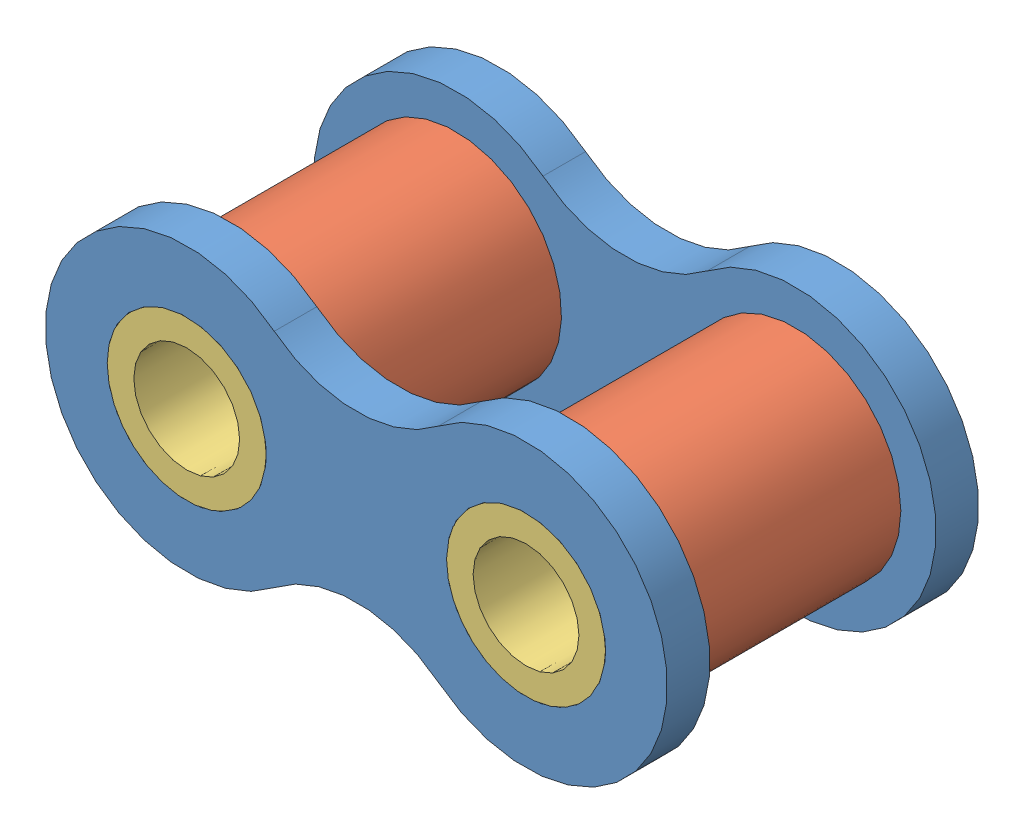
SolidWorks assembly Outside Link.SLDASM, configuration Default (file format 15000). Lengths in mm.
Overall size (34.92 15.88 17.48).
6 component instances, 3 part files, 11 mates.
Components (placement in the parent):
- Link Plate-1: Link Plate.SLDPRT [Inside] at origin size (34.92 15.88 2.39)
- Link Plate-2: Link Plate.SLDPRT [Inside] at (0 0 -15.0876) size (34.92 15.88 2.39)
- Roller-1: Roller.SLDPRT [Default] at (0 0 -6.35) x (0.971201 -0.238261 0) z (0 0 1) size (11.91 11.91 12.7)
- Roller-2: Roller.SLDPRT [Default] at (19.05 0 -6.35) size (11.91 11.91 12.7)
- Bushing-1: Bushing.SLDPRT [Default] at (0 0 -6.35) size (8.93 8.93 17.48)
- Bushing-2: Bushing.SLDPRT [Default] at (19.05 0 -6.35) size (8.93 8.93 17.48)
Mates (geometry in assembly coordinates):
- Concentric1: concentric aligned: cylinder of Link Plate-1 through (0 0 2.3876) axis (0 0 -1) radius 4.464; cylinder of Roller-1 through (0 0 0) axis (0 0 -1) radius 4.464
- Coincident1: coincident anti-aligned: plane of Link Plate-1 through (4.7625 -6.0378 0) normal (0 0 -1); plane of Roller-1 through (0 0 0) normal (0 0 1)
- Concentric2: concentric aligned: cylinder of Link Plate-1 through (19.05 0 2.3876) axis (0 0 -1) radius 4.464; cylinder of Roller-2 through (19.05 0 0) axis (0 0 -1) radius 4.464
- Coincident2: coincident anti-aligned: plane of Link Plate-1 through (4.7625 -6.0378 0) normal (0 0 -1); plane of Roller-2 through (19.05 0 0) normal (0 0 1)
- Concentric3: concentric aligned: cylinder of Link Plate-2 through (0 0 -12.7) axis (0 0 -1) radius 4.464; cylinder of Roller-1 through (0 0 0) axis (0 0 -1) radius 4.464
- Coincident3: coincident anti-aligned: plane of Link Plate-2 through (4.7625 -6.0378 -12.7) normal (0 0 1); plane of Roller-1 through (0 0 -12.7) normal (0 0 -1)
- Concentric4: concentric aligned: cylinder of Link Plate-2 through (19.05 0 -12.7) axis (0 0 -1) radius 4.464; cylinder of Roller-2 through (19.05 0 0) axis (0 0 -1) radius 4.464
- Concentric5: concentric aligned: cylinder of Link Plate-1 through (0 0 2.3876) axis (0 0 -1) radius 4.464; cylinder of Bushing-1 through (0 0 2.3876) axis (0 0 -1) radius 4.464
- Coincident4: coincident aligned: plane of Link Plate-1 through (4.7625 -6.0378 2.3876) normal (0 0 1); plane of Bushing-1 through (0 0 2.3876) normal (0 0 1)
- Concentric6: concentric aligned: cylinder of Link Plate-1 through (19.05 0 2.3876) axis (0 0 -1) radius 4.464; cylinder of Bushing-2 through (19.05 0 2.3876) axis (0 0 -1) radius 4.464
- Coincident5: coincident aligned: plane of Link Plate-1 through (4.7625 -6.0378 2.3876) normal (0 0 1); plane of Bushing-2 through (19.05 0 2.3876) normal (0 0 1)
